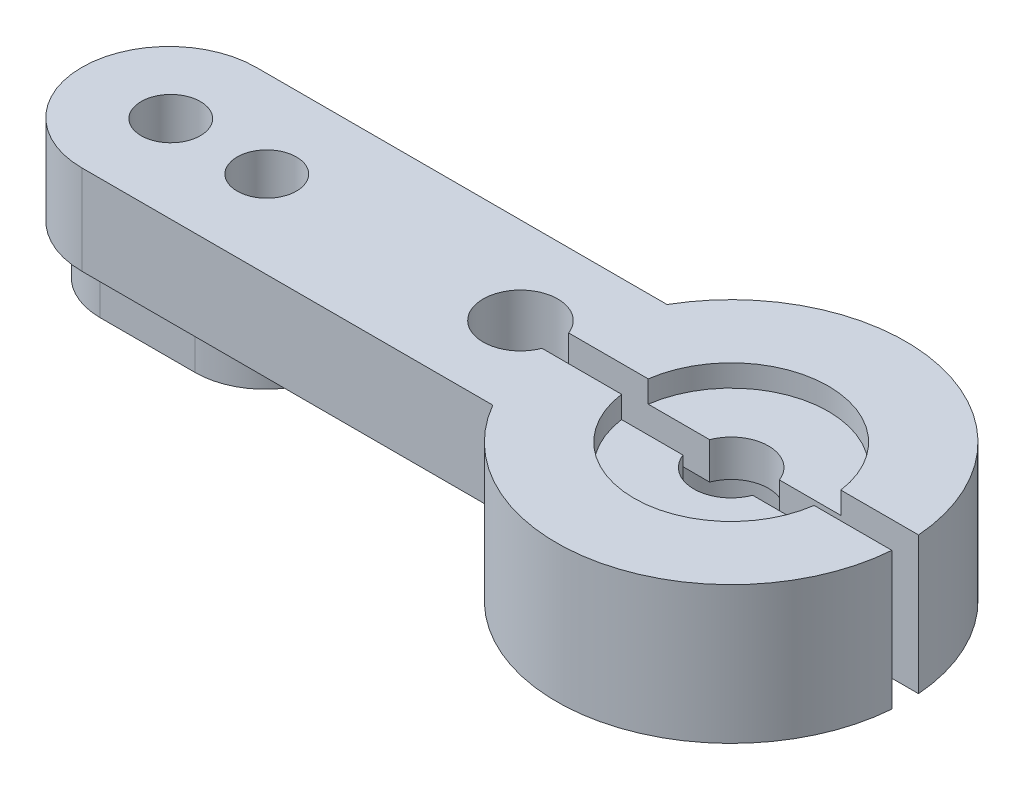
from build123d import *

# Parameters (mm, degrees)
SKETCH1_R           = 7.4803
BOSS_EXTRUDE1_DEPTH = 5.8928
SKETCH2_R           = 2.7813
CUT_EXTRUDE1_DEPTH  = 3.3782
BOSS_EXTRUDE2_START = -3.8354
BOSS_EXTRUDE2_DEPTH = 3.8354
BOSS_EXTRUDE3_DEPTH = 2.0574
SKETCH6_R           = 4.1656
CUT_EXTRUDE2_DEPTH  = 0.9398
SKETCH7_R           = 1.6002
SKETCH7_R_2         = 1.27
SKETCH7_W           = 18.255027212
SKETCH7_H           = 1.143
CUT_EXTRUDE3_DEPTH  = 30.410024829


with BuildPart() as part:
    # Sketch1 → Boss-Extrude1 (new body)
    with BuildSketch(Plane(origin=(0, 0, 0), x_dir=(1, 0, 0), z_dir=(0, 1, 0))):
        with Locations(Location((0, 0, 0), (0, 0, 270))):
            Circle(SKETCH1_R)
    extrude(amount=BOSS_EXTRUDE1_DEPTH)

    # Sketch2 → Cut-Extrude1 (cut)
    with BuildSketch(Plane.XZ):
        with Locations(Location((0, 0, 0), (0, 0, 270))):
            Circle(SKETCH2_R)
    extrude(amount=-CUT_EXTRUDE1_DEPTH, mode=Mode.SUBTRACT)

    # Sketch4 → Boss-Extrude2 (add)
    with BuildSketch(Plane(origin=(0, 5.8928, 0), x_dir=(1, 0, 0), z_dir=(0, 1, 0)).offset(BOSS_EXTRUDE2_START)):
        with BuildLine():
            Line((-24.0919, 3.7338), (-6.481791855, 3.7338))
            ThreePointArc((-6.481791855, 3.7338), (-7.4803, 0), (-6.481791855, -3.7338))
            Line((-6.481791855, -3.7338), (-24.0919, -3.7338))
            ThreePointArc((-24.0919, -3.7338), (-27.8257, 0), (-24.0919, 3.7338))
        make_face()
    extrude(amount=BOSS_EXTRUDE2_DEPTH)

    # Sketch5 → Boss-Extrude3 (add)
    with BuildSketch(Plane.XZ.offset(-2.0574)):
        with BuildLine():
            Line((-24.0284, 3.0099), (-19.9644, 3.0099))
            ThreePointArc((-19.9644, 3.0099), (-16.9545, 0), (-19.9644, -3.0099))
            Line((-19.9644, -3.0099), (-24.0284, -3.0099))
            ThreePointArc((-24.0284, -3.0099), (-27.0383, 0), (-24.0284, 3.0099))
        make_face()
    extrude(amount=BOSS_EXTRUDE3_DEPTH)

    # Sketch6 → Cut-Extrude2 (cut)
    with BuildSketch(Plane(origin=(0, 5.8928, 0), x_dir=(1, 0, 0), z_dir=(0, 1, 0))):
        with Locations(Location((0, 0, 0), (0, 0, 270))):
            Circle(SKETCH6_R)
    extrude(amount=-CUT_EXTRUDE2_DEPTH, mode=Mode.SUBTRACT)

    # Sketch7 → Cut-Extrude3 (cut, through all)
    with BuildSketch(Plane(origin=(0, 5.8928, 0), x_dir=(1, 0, 0), z_dir=(0, 1, 0))):
        with Locations((-9.0297, 0)):
            Circle(SKETCH7_R)
        Circle(SKETCH7_R)
        with Locations(Location((-24.0157, 0, 0), (0, 0, 270))):
            Circle(SKETCH7_R_2)
        with Locations(Location((-19.9009, 0, 0), (0, 0, 270))):
            Circle(SKETCH7_R_2)
        with Locations((0.097813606, 0)):
            Rectangle(SKETCH7_W, SKETCH7_H)
    extrude(amount=-CUT_EXTRUDE3_DEPTH, mode=Mode.SUBTRACT)


solid = part.part
